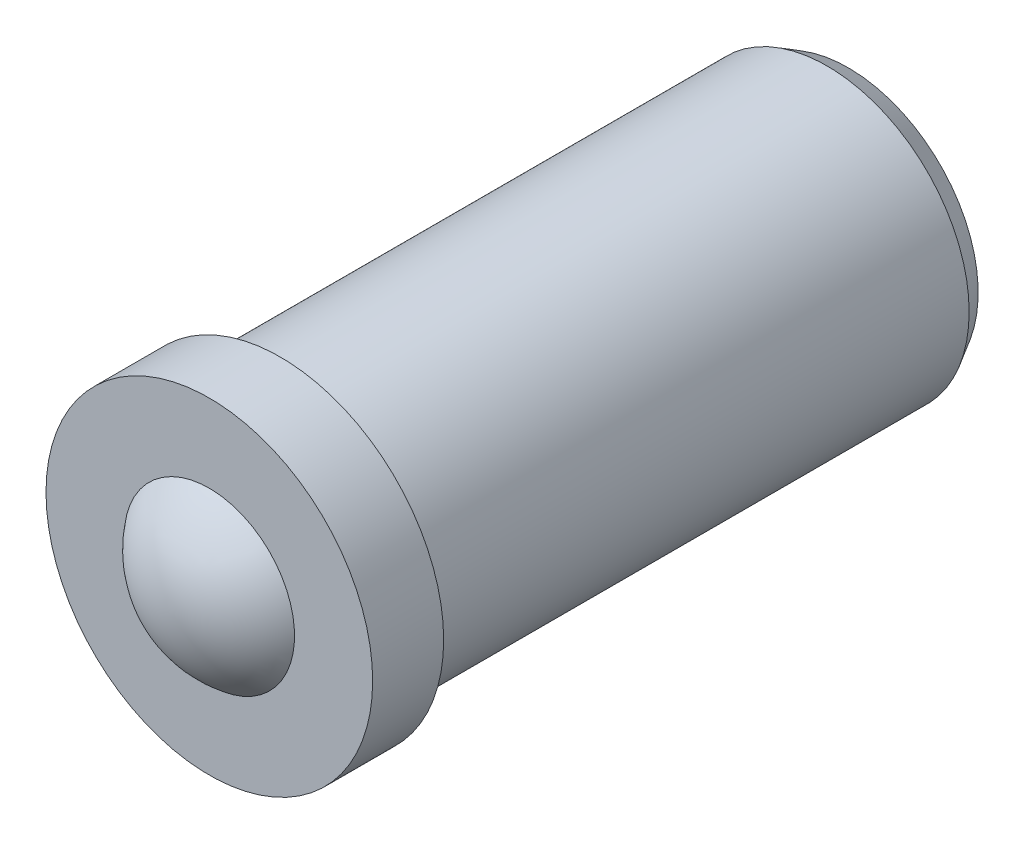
ISO-10303-21;
HEADER;
FILE_DESCRIPTION(('STEP AP214'),'2;1');
FILE_NAME('part.step','',(''),(''),'','','');
FILE_SCHEMA(('AUTOMOTIVE_DESIGN { 1 0 10303 214 1 1 1 1 }'));
ENDSEC;
DATA;
#1=APPLICATION_CONTEXT('core data for automotive mechanical design processes');
#2=APPLICATION_PROTOCOL_DEFINITION('international standard','automotive_design',2000,#1);
#3=PRODUCT_CONTEXT('',#1,'mechanical');
#4=PRODUCT('Part','Part','',(#3));
#5=PRODUCT_RELATED_PRODUCT_CATEGORY('part','',(#4));
#6=PRODUCT_DEFINITION_FORMATION('','',#4);
#7=PRODUCT_DEFINITION_CONTEXT('part definition',#1,'design');
#8=PRODUCT_DEFINITION('design','',#6,#7);
#9=PRODUCT_DEFINITION_SHAPE('','',#8);
#10=(LENGTH_UNIT() NAMED_UNIT(*) SI_UNIT(.MILLI.,.METRE.));
#11=(NAMED_UNIT(*) PLANE_ANGLE_UNIT() SI_UNIT($,.RADIAN.));
#12=(NAMED_UNIT(*) SI_UNIT($,.STERADIAN.) SOLID_ANGLE_UNIT());
#13=UNCERTAINTY_MEASURE_WITH_UNIT(LENGTH_MEASURE(1.E-05),#10,'distance_accuracy_value','');
#14=(GEOMETRIC_REPRESENTATION_CONTEXT(3) GLOBAL_UNCERTAINTY_ASSIGNED_CONTEXT((#13)) GLOBAL_UNIT_ASSIGNED_CONTEXT((#10,
#11,#12)) REPRESENTATION_CONTEXT('',''));
#15=CARTESIAN_POINT('',(0.,0.,0.));
#16=DIRECTION('',(0.,0.,1.));
#17=DIRECTION('',(1.,0.,0.));
#18=AXIS2_PLACEMENT_3D('',#15,#16,#17);
#19=CARTESIAN_POINT('',(0.,0.,1.));
#20=DIRECTION('',(0.,0.,1.));
#21=DIRECTION('',(-1.,0.,0.));
#22=AXIS2_PLACEMENT_3D('',#19,#20,#21);
#23=CYLINDRICAL_SURFACE('',#22,2.);
#24=CARTESIAN_POINT('',(0.,0.,-7.7));
#25=DIRECTION('',(0.,0.,-1.));
#26=DIRECTION('',(-1.,0.,0.));
#27=AXIS2_PLACEMENT_3D('',#24,#25,#26);
#28=CIRCLE('',#27,2.);
#29=CARTESIAN_POINT('',(-2.,0.,-7.7));
#30=VERTEX_POINT('',#29);
#31=EDGE_CURVE('E8',#30,#30,#28,.F.);
#32=ORIENTED_EDGE('',*,*,#31,.T.);
#33=EDGE_LOOP('',(#32));
#34=FACE_BOUND('',#33,.T.);
#35=CARTESIAN_POINT('',(0.,0.,0.));
#36=DIRECTION('',(0.,0.,1.));
#37=DIRECTION('',(-1.,0.,0.));
#38=AXIS2_PLACEMENT_3D('',#35,#36,#37);
#39=CIRCLE('',#38,2.);
#40=CARTESIAN_POINT('',(-2.,0.,0.));
#41=VERTEX_POINT('',#40);
#42=EDGE_CURVE('E27',#41,#41,#39,.T.);
#43=ORIENTED_EDGE('',*,*,#42,.F.);
#44=EDGE_LOOP('',(#43));
#45=FACE_BOUND('',#44,.T.);
#46=ADVANCED_FACE('F12',(#34,#45),#23,.T.);
#47=CARTESIAN_POINT('',(-2.,0.,0.));
#48=DIRECTION('',(0.,0.,1.));
#49=DIRECTION('',(-1.,0.,0.));
#50=AXIS2_PLACEMENT_3D('',#47,#48,#49);
#51=PLANE('',#50);
#52=CARTESIAN_POINT('',(0.,0.,0.));
#53=DIRECTION('',(0.,0.,1.));
#54=DIRECTION('',(-1.,0.,0.));
#55=AXIS2_PLACEMENT_3D('',#52,#53,#54);
#56=CIRCLE('',#55,2.3);
#57=CARTESIAN_POINT('',(-2.3,0.,0.));
#58=VERTEX_POINT('',#57);
#59=EDGE_CURVE('E32',#58,#58,#56,.T.);
#60=ORIENTED_EDGE('',*,*,#59,.F.);
#61=EDGE_LOOP('',(#60));
#62=FACE_BOUND('',#61,.T.);
#63=ORIENTED_EDGE('',*,*,#42,.T.);
#64=EDGE_LOOP('',(#63));
#65=FACE_BOUND('',#64,.T.);
#66=ADVANCED_FACE('F45',(#62,#65),#51,.F.);
#67=CARTESIAN_POINT('',(0.,0.,1.));
#68=DIRECTION('',(0.,0.,1.));
#69=DIRECTION('',(-1.,0.,0.));
#70=AXIS2_PLACEMENT_3D('',#67,#68,#69);
#71=CYLINDRICAL_SURFACE('',#70,2.3);
#72=CARTESIAN_POINT('',(0.,0.,1.));
#73=DIRECTION('',(0.,0.,1.));
#74=DIRECTION('',(-1.,0.,0.));
#75=AXIS2_PLACEMENT_3D('',#72,#73,#74);
#76=CIRCLE('',#75,2.3);
#77=CARTESIAN_POINT('',(-2.3,0.,1.));
#78=VERTEX_POINT('',#77);
#79=EDGE_CURVE('E35',#78,#78,#76,.T.);
#80=ORIENTED_EDGE('',*,*,#79,.F.);
#81=EDGE_LOOP('',(#80));
#82=FACE_BOUND('',#81,.T.);
#83=ORIENTED_EDGE('',*,*,#59,.T.);
#84=EDGE_LOOP('',(#83));
#85=FACE_BOUND('',#84,.T.);
#86=ADVANCED_FACE('F42',(#82,#85),#71,.T.);
#87=CARTESIAN_POINT('',(-2.3,0.,1.));
#88=DIRECTION('',(0.,0.,-1.));
#89=DIRECTION('',(1.,0.,0.));
#90=AXIS2_PLACEMENT_3D('',#87,#88,#89);
#91=PLANE('',#90);
#92=ORIENTED_EDGE('',*,*,#79,.T.);
#93=EDGE_LOOP('',(#92));
#94=FACE_BOUND('',#93,.T.);
#95=CARTESIAN_POINT('',(0.,0.,1.));
#96=DIRECTION('',(0.,0.,1.));
#97=DIRECTION('',(-1.,0.,0.));
#98=AXIS2_PLACEMENT_3D('',#95,#96,#97);
#99=CIRCLE('',#98,1.2);
#100=CARTESIAN_POINT('',(-1.2,0.,1.));
#101=VERTEX_POINT('',#100);
#102=EDGE_CURVE('E23',#101,#101,#99,.F.);
#103=ORIENTED_EDGE('',*,*,#102,.T.);
#104=EDGE_LOOP('',(#103));
#105=FACE_BOUND('',#104,.T.);
#106=ADVANCED_FACE('F39',(#94,#105),#91,.F.);
#107=CARTESIAN_POINT('',(0.,0.,0.1));
#108=DIRECTION('',(0.,0.,-1.));
#109=DIRECTION('',(-1.,0.,0.));
#110=AXIS2_PLACEMENT_3D('',#107,#108,#109);
#111=SPHERICAL_SURFACE('',#110,1.5);
#112=ORIENTED_EDGE('',*,*,#102,.F.);
#113=EDGE_LOOP('',(#112));
#114=FACE_BOUND('',#113,.T.);
#115=ADVANCED_FACE('F61',(#114),#111,.T.);
#116=CARTESIAN_POINT('',(0.,0.,-8.));
#117=DIRECTION('',(0.,0.,-1.));
#118=DIRECTION('',(-1.,0.,0.));
#119=AXIS2_PLACEMENT_3D('',#116,#117,#118);
#120=PLANE('',#119);
#121=CARTESIAN_POINT('',(0.,0.,-8.));
#122=DIRECTION('',(0.,0.,-1.));
#123=DIRECTION('',(-1.,0.,0.));
#124=AXIS2_PLACEMENT_3D('',#121,#122,#123);
#125=CIRCLE('',#124,1.82679491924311);
#126=CARTESIAN_POINT('',(-1.82679491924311,0.,-8.));
#127=VERTEX_POINT('',#126);
#128=EDGE_CURVE('E19',#127,#127,#125,.T.);
#129=ORIENTED_EDGE('',*,*,#128,.T.);
#130=EDGE_LOOP('',(#129));
#131=FACE_BOUND('',#130,.T.);
#132=ADVANCED_FACE('F64',(#131),#120,.T.);
#133=CARTESIAN_POINT('',(0.,0.,-8.));
#134=DIRECTION('',(0.,0.,1.));
#135=DIRECTION('',(1.,0.,0.));
#136=AXIS2_PLACEMENT_3D('',#133,#134,#135);
#137=CONICAL_SURFACE('',#136,1.82679491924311,0.523598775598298);
#138=ORIENTED_EDGE('',*,*,#31,.F.);
#139=EDGE_LOOP('',(#138));
#140=FACE_BOUND('',#139,.T.);
#141=ORIENTED_EDGE('',*,*,#128,.F.);
#142=EDGE_LOOP('',(#141));
#143=FACE_BOUND('',#142,.T.);
#144=ADVANCED_FACE('F14',(#140,#143),#137,.T.);
#145=CLOSED_SHELL('',(#46,#66,#86,#106,#115,#132,#144));
#146=MANIFOLD_SOLID_BREP('B1',#145);
#147=ADVANCED_BREP_SHAPE_REPRESENTATION('',(#18,#146),#14);
#148=SHAPE_DEFINITION_REPRESENTATION(#9,#147);
ENDSEC;
END-ISO-10303-21;
